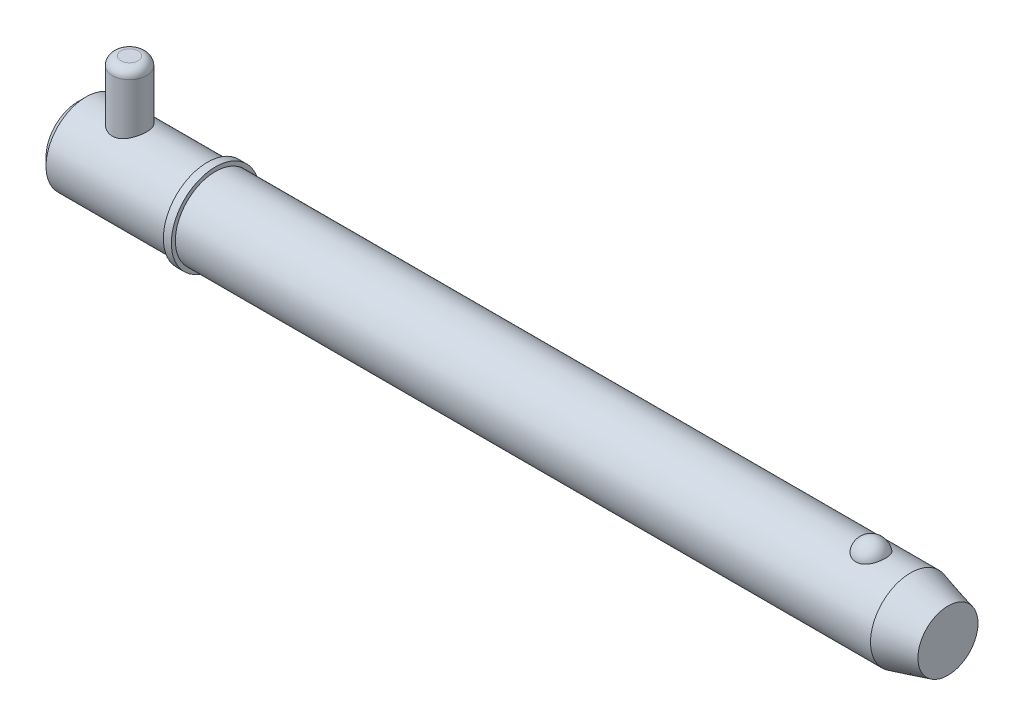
ISO-10303-21;
HEADER;
FILE_DESCRIPTION(('STEP AP214'),'2;1');
FILE_NAME('part.step','',(''),(''),'','','');
FILE_SCHEMA(('AUTOMOTIVE_DESIGN { 1 0 10303 214 1 1 1 1 }'));
ENDSEC;
DATA;
#1=APPLICATION_CONTEXT('core data for automotive mechanical design processes');
#2=APPLICATION_PROTOCOL_DEFINITION('international standard','automotive_design',2000,#1);
#3=PRODUCT_CONTEXT('',#1,'mechanical');
#4=PRODUCT('Part','Part','',(#3));
#5=PRODUCT_RELATED_PRODUCT_CATEGORY('part','',(#4));
#6=PRODUCT_DEFINITION_FORMATION('','',#4);
#7=PRODUCT_DEFINITION_CONTEXT('part definition',#1,'design');
#8=PRODUCT_DEFINITION('design','',#6,#7);
#9=PRODUCT_DEFINITION_SHAPE('','',#8);
#10=(LENGTH_UNIT() NAMED_UNIT(*) SI_UNIT(.MILLI.,.METRE.));
#11=(NAMED_UNIT(*) PLANE_ANGLE_UNIT() SI_UNIT($,.RADIAN.));
#12=(NAMED_UNIT(*) SI_UNIT($,.STERADIAN.) SOLID_ANGLE_UNIT());
#13=UNCERTAINTY_MEASURE_WITH_UNIT(LENGTH_MEASURE(1.E-05),#10,'distance_accuracy_value','');
#14=(GEOMETRIC_REPRESENTATION_CONTEXT(3) GLOBAL_UNCERTAINTY_ASSIGNED_CONTEXT((#13)) GLOBAL_UNIT_ASSIGNED_CONTEXT((#10,
#11,#12)) REPRESENTATION_CONTEXT('',''));
#15=CARTESIAN_POINT('',(0.,0.,0.));
#16=DIRECTION('',(0.,0.,1.));
#17=DIRECTION('',(1.,0.,0.));
#18=AXIS2_PLACEMENT_3D('',#15,#16,#17);
#19=CARTESIAN_POINT('',(14.28,26.985,0.));
#20=DIRECTION('',(0.,-1.,0.));
#21=DIRECTION('',(0.,0.,-1.));
#22=AXIS2_PLACEMENT_3D('',#19,#20,#21);
#23=CYLINDRICAL_SURFACE('',#22,4.76);
#24=CARTESIAN_POINT('',(14.28,-8.73500000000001,0.));
#25=DIRECTION('',(0.,1.,0.));
#26=DIRECTION('',(0.,0.,1.));
#27=AXIS2_PLACEMENT_3D('',#24,#25,#26);
#28=CIRCLE('',#27,4.76);
#29=CARTESIAN_POINT('',(14.28,-8.73500000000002,-4.76));
#30=VERTEX_POINT('',#29);
#31=EDGE_CURVE('P0_E25',#30,#30,#28,.T.);
#32=CARTESIAN_POINT('',(14.28,24.605,0.));
#33=DIRECTION('',(0.,1.,0.));
#34=DIRECTION('',(0.,0.,1.));
#35=AXIS2_PLACEMENT_3D('',#32,#33,#34);
#36=CIRCLE('',#35,4.76);
#37=CARTESIAN_POINT('',(14.28,24.605,-4.76));
#38=VERTEX_POINT('',#37);
#39=EDGE_CURVE('P0_E29',#38,#38,#36,.F.);
#40=CARTESIAN_POINT('',(14.28,-8.73500000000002,-4.76));
#41=CARTESIAN_POINT('',(14.28,-8.38770833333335,-4.76));
#42=CARTESIAN_POINT('',(14.28,-8.04041666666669,-4.76));
#43=CARTESIAN_POINT('',(14.28,-7.34583333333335,-4.76));
#44=CARTESIAN_POINT('',(14.28,-6.99854166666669,-4.76));
#45=CARTESIAN_POINT('',(14.28,-6.30395833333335,-4.76));
#46=CARTESIAN_POINT('',(14.28,-5.95666666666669,-4.76));
#47=CARTESIAN_POINT('',(14.28,-5.26208333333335,-4.76));
#48=CARTESIAN_POINT('',(14.28,-4.91479166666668,-4.76));
#49=CARTESIAN_POINT('',(14.28,-4.22020833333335,-4.76));
#50=CARTESIAN_POINT('',(14.28,-3.87291666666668,-4.76));
#51=CARTESIAN_POINT('',(14.28,-3.17833333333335,-4.76));
#52=CARTESIAN_POINT('',(14.28,-2.83104166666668,-4.76));
#53=CARTESIAN_POINT('',(14.28,-2.13645833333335,-4.76));
#54=CARTESIAN_POINT('',(14.28,-1.78916666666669,-4.76));
#55=CARTESIAN_POINT('',(14.28,-1.09458333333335,-4.76));
#56=CARTESIAN_POINT('',(14.28,-0.747291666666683,-4.76));
#57=CARTESIAN_POINT('',(14.28,-0.052708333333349,-4.76));
#58=CARTESIAN_POINT('',(14.28,0.294583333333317,-4.76));
#59=CARTESIAN_POINT('',(14.28,0.989166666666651,-4.76));
#60=CARTESIAN_POINT('',(14.28,1.33645833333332,-4.76));
#61=CARTESIAN_POINT('',(14.28,2.03104166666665,-4.76));
#62=CARTESIAN_POINT('',(14.28,2.37833333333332,-4.76));
#63=CARTESIAN_POINT('',(14.28,3.07291666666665,-4.76));
#64=CARTESIAN_POINT('',(14.28,3.42020833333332,-4.76));
#65=CARTESIAN_POINT('',(14.28,4.11479166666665,-4.76));
#66=CARTESIAN_POINT('',(14.28,4.46208333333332,-4.76));
#67=CARTESIAN_POINT('',(14.28,5.15666666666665,-4.76));
#68=CARTESIAN_POINT('',(14.28,5.50395833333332,-4.76));
#69=CARTESIAN_POINT('',(14.28,6.19854166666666,-4.76));
#70=CARTESIAN_POINT('',(14.28,6.54583333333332,-4.76));
#71=CARTESIAN_POINT('',(14.28,7.24041666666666,-4.76));
#72=CARTESIAN_POINT('',(14.28,7.58770833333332,-4.76));
#73=CARTESIAN_POINT('',(14.28,8.28229166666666,-4.76));
#74=CARTESIAN_POINT('',(14.28,8.62958333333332,-4.76));
#75=CARTESIAN_POINT('',(14.28,9.32416666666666,-4.76));
#76=CARTESIAN_POINT('',(14.28,9.67145833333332,-4.76));
#77=CARTESIAN_POINT('',(14.28,10.3660416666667,-4.76));
#78=CARTESIAN_POINT('',(14.28,10.7133333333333,-4.76));
#79=CARTESIAN_POINT('',(14.28,11.4079166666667,-4.76));
#80=CARTESIAN_POINT('',(14.28,11.7552083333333,-4.76));
#81=CARTESIAN_POINT('',(14.28,12.4497916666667,-4.76));
#82=CARTESIAN_POINT('',(14.28,12.7970833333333,-4.76));
#83=CARTESIAN_POINT('',(14.28,13.4916666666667,-4.76));
#84=CARTESIAN_POINT('',(14.28,13.8389583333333,-4.76));
#85=CARTESIAN_POINT('',(14.28,14.5335416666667,-4.76));
#86=CARTESIAN_POINT('',(14.28,14.8808333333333,-4.76));
#87=CARTESIAN_POINT('',(14.28,15.5754166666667,-4.76));
#88=CARTESIAN_POINT('',(14.28,15.9227083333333,-4.76));
#89=CARTESIAN_POINT('',(14.28,16.6172916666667,-4.76));
#90=CARTESIAN_POINT('',(14.28,16.9645833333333,-4.76));
#91=CARTESIAN_POINT('',(14.28,17.6591666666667,-4.76));
#92=CARTESIAN_POINT('',(14.28,18.0064583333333,-4.76));
#93=CARTESIAN_POINT('',(14.28,18.7010416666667,-4.76));
#94=CARTESIAN_POINT('',(14.28,19.0483333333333,-4.76));
#95=CARTESIAN_POINT('',(14.28,19.7429166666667,-4.76));
#96=CARTESIAN_POINT('',(14.28,20.0902083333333,-4.76));
#97=CARTESIAN_POINT('',(14.28,20.7847916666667,-4.76));
#98=CARTESIAN_POINT('',(14.28,21.1320833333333,-4.76));
#99=CARTESIAN_POINT('',(14.28,21.8266666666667,-4.76));
#100=CARTESIAN_POINT('',(14.28,22.1739583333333,-4.76));
#101=CARTESIAN_POINT('',(14.28,22.8685416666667,-4.76));
#102=CARTESIAN_POINT('',(14.28,23.2158333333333,-4.76));
#103=CARTESIAN_POINT('',(14.28,23.9104166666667,-4.76));
#104=CARTESIAN_POINT('',(14.28,24.2577083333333,-4.76));
#105=CARTESIAN_POINT('',(14.28,24.605,-4.76));
#106=B_SPLINE_CURVE_WITH_KNOTS('',3,(#40,#41,#42,#43,#44,#45,#46,#47,#48,#49,#50,#51,#52,#53,
#54,#55,#56,#57,#58,#59,#60,#61,#62,#63,#64,#65,#66,#67,#68,#69,#70,#71,#72,#73,#74,#75,#76,#77,
#78,#79,#80,#81,#82,#83,#84,#85,#86,#87,#88,#89,#90,#91,#92,#93,#94,#95,#96,#97,#98,#99,#100,
#101,#102,#103,#104,#105),.UNSPECIFIED.,.F.,.F.,(4,2,2,2,2,2,2,2,2,2,2,2,2,2,2,2,2,2,2,2,2,2,2,
2,2,2,2,2,2,2,2,2,4),(0.,1.041875,2.08375,3.125625,4.1675,5.209375,6.25125,7.293125,
8.33500000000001,9.376875,10.41875,11.460625,12.5025,13.544375,14.58625,15.628125,16.67,
17.711875,18.75375,19.795625,20.8375,21.879375,22.92125,23.963125,25.005,26.046875,27.08875,
28.130625,29.1725,30.214375,31.25625,32.298125,33.34),.UNSPECIFIED.);
#107=EDGE_CURVE('P0_BSEAM14',#30,#38,#106,.T.);
#108=ORIENTED_EDGE('',*,*,#31,.T.);
#109=ORIENTED_EDGE('',*,*,#39,.T.);
#110=ORIENTED_EDGE('',*,*,#107,.T.);
#111=ORIENTED_EDGE('',*,*,#107,.F.);
#112=EDGE_LOOP('',(#108,#110,#109,#111));
#113=FACE_BOUND('',#112,.T.);
#114=ADVANCED_FACE('P0_F14',(#113),#23,.T.);
#115=CARTESIAN_POINT('',(14.28,26.985,0.));
#116=DIRECTION('',(0.,1.,0.));
#117=DIRECTION('',(0.,0.,1.));
#118=AXIS2_PLACEMENT_3D('',#115,#116,#117);
#119=PLANE('',#118);
#120=CARTESIAN_POINT('',(14.28,26.985,0.));
#121=DIRECTION('',(0.,1.,0.));
#122=DIRECTION('',(0.,0.,1.));
#123=AXIS2_PLACEMENT_3D('',#120,#121,#122);
#124=CIRCLE('',#123,2.38);
#125=CARTESIAN_POINT('',(14.28,26.985,2.38));
#126=VERTEX_POINT('',#125);
#127=EDGE_CURVE('P0_E10',#126,#126,#124,.T.);
#128=ORIENTED_EDGE('',*,*,#127,.T.);
#129=EDGE_LOOP('',(#128));
#130=FACE_BOUND('',#129,.T.);
#131=ADVANCED_FACE('P0_F46',(#130),#119,.T.);
#132=CARTESIAN_POINT('',(14.28,-11.115,0.));
#133=DIRECTION('',(0.,1.,0.));
#134=DIRECTION('',(0.,0.,1.));
#135=AXIS2_PLACEMENT_3D('',#132,#133,#134);
#136=PLANE('',#135);
#137=CARTESIAN_POINT('',(14.28,-11.115,0.));
#138=DIRECTION('',(0.,1.,0.));
#139=DIRECTION('',(0.,0.,1.));
#140=AXIS2_PLACEMENT_3D('',#137,#138,#139);
#141=CIRCLE('',#140,2.38);
#142=CARTESIAN_POINT('',(14.28,-11.115,2.38));
#143=VERTEX_POINT('',#142);
#144=EDGE_CURVE('P0_E21',#143,#143,#141,.F.);
#145=ORIENTED_EDGE('',*,*,#144,.T.);
#146=EDGE_LOOP('',(#145));
#147=FACE_BOUND('',#146,.T.);
#148=ADVANCED_FACE('P0_F43',(#147),#136,.F.);
#149=CARTESIAN_POINT('',(14.28,-8.735,0.));
#150=DIRECTION('',(0.,1.,0.));
#151=DIRECTION('',(0.,0.,1.));
#152=AXIS2_PLACEMENT_3D('',#149,#150,#151);
#153=DEGENERATE_TOROIDAL_SURFACE('',#152,2.38,2.38,.T.);
#154=ORIENTED_EDGE('',*,*,#144,.F.);
#155=EDGE_LOOP('',(#154));
#156=FACE_BOUND('',#155,.T.);
#157=ORIENTED_EDGE('',*,*,#31,.F.);
#158=EDGE_LOOP('',(#157));
#159=FACE_BOUND('',#158,.T.);
#160=ADVANCED_FACE('P0_F38',(#156,#159),#153,.T.);
#161=CARTESIAN_POINT('',(14.28,24.605,0.));
#162=DIRECTION('',(0.,1.,0.));
#163=DIRECTION('',(0.,0.,1.));
#164=AXIS2_PLACEMENT_3D('',#161,#162,#163);
#165=DEGENERATE_TOROIDAL_SURFACE('',#164,2.38,2.38,.T.);
#166=ORIENTED_EDGE('',*,*,#39,.F.);
#167=EDGE_LOOP('',(#166));
#168=FACE_BOUND('',#167,.T.);
#169=ORIENTED_EDGE('',*,*,#127,.F.);
#170=EDGE_LOOP('',(#169));
#171=FACE_BOUND('',#170,.T.);
#172=ADVANCED_FACE('P0_F16',(#168,#171),#165,.T.);
#173=CLOSED_SHELL('',(#114,#131,#148,#160,#172));
#174=MANIFOLD_SOLID_BREP('P0_B1',#173);
#175=CARTESIAN_POINT('',(0.,0.,0.));
#176=DIRECTION('',(1.,0.,0.));
#177=DIRECTION('',(0.,0.,-1.));
#178=AXIS2_PLACEMENT_3D('',#175,#176,#177);
#179=CYLINDRICAL_SURFACE('',#178,11.115);
#180=CARTESIAN_POINT('',(230.929563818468,0.,0.));
#181=DIRECTION('',(1.,0.,0.));
#182=DIRECTION('',(0.,0.,-1.));
#183=AXIS2_PLACEMENT_3D('',#180,#181,#182);
#184=CIRCLE('',#183,11.115);
#185=CARTESIAN_POINT('',(230.929563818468,0.,-11.115));
#186=VERTEX_POINT('',#185);
#187=EDGE_CURVE('P1_E81',#186,#186,#184,.T.);
#188=ORIENTED_EDGE('',*,*,#187,.F.);
#189=EDGE_LOOP('',(#188));
#190=FACE_BOUND('',#189,.T.);
#191=CARTESIAN_POINT('',(38.1,0.,0.));
#192=DIRECTION('',(1.,0.,0.));
#193=DIRECTION('',(0.,0.,-1.));
#194=AXIS2_PLACEMENT_3D('',#191,#192,#193);
#195=CIRCLE('',#194,11.115);
#196=CARTESIAN_POINT('',(38.1,0.,-11.115));
#197=VERTEX_POINT('',#196);
#198=EDGE_CURVE('P1_E85',#197,#197,#195,.T.);
#199=ORIENTED_EDGE('',*,*,#198,.T.);
#200=EDGE_LOOP('',(#199));
#201=FACE_BOUND('',#200,.T.);
#202=CARTESIAN_POINT('',(219.931068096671,10.3028087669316,4.17077409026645));
#203=CARTESIAN_POINT('',(219.714775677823,10.3028003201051,4.17078240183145));
#204=CARTESIAN_POINT('',(219.498548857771,10.3098895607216,4.15340593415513));
#205=CARTESIAN_POINT('',(219.072540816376,10.3373834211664,4.08449540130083));
#206=CARTESIAN_POINT('',(218.862757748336,10.3577841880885,4.0329712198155));
#207=CARTESIAN_POINT('',(218.455782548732,10.4095237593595,3.89746513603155));
#208=CARTESIAN_POINT('',(218.258572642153,10.4408466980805,3.81353029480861));
#209=CARTESIAN_POINT('',(217.881338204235,10.5110236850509,3.61560339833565));
#210=CARTESIAN_POINT('',(217.701317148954,10.5498792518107,3.50160528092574));
#211=CARTESIAN_POINT('',(217.357684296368,10.6322884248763,3.24292464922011));
#212=CARTESIAN_POINT('',(217.194686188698,10.6759443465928,3.09746040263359));
#213=CARTESIAN_POINT('',(216.894591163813,10.7625291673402,2.7817192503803));
#214=CARTESIAN_POINT('',(216.757499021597,10.8054579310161,2.61143778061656));
#215=CARTESIAN_POINT('',(216.506408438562,10.8881935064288,2.24226695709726));
#216=CARTESIAN_POINT('',(216.393710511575,10.9277761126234,2.04244123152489));
#217=CARTESIAN_POINT('',(216.201777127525,10.997484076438,1.62578254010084));
#218=CARTESIAN_POINT('',(216.122544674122,11.0276085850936,1.40894804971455));
#219=CARTESIAN_POINT('',(215.998303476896,11.0756732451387,0.961250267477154));
#220=CARTESIAN_POINT('',(215.953760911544,11.0934470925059,0.730239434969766));
#221=CARTESIAN_POINT('',(215.901569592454,11.1143331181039,0.263439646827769));
#222=CARTESIAN_POINT('',(215.893920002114,11.1174456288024,0.0276507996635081));
#223=CARTESIAN_POINT('',(215.91561056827,11.1087161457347,-0.440729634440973));
#224=CARTESIAN_POINT('',(215.944762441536,11.0969502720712,-0.6733313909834));
#225=CARTESIAN_POINT('',(216.039143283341,11.0597872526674,-1.12996621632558));
#226=CARTESIAN_POINT('',(216.104372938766,11.0343898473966,-1.35399912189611));
#227=CARTESIAN_POINT('',(216.26969844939,10.972515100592,-1.78750286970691));
#228=CARTESIAN_POINT('',(216.36983863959,10.9360236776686,-1.99695478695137));
#229=CARTESIAN_POINT('',(216.602940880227,10.8557595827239,-2.39520667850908));
#230=CARTESIAN_POINT('',(216.735905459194,10.8119863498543,-2.58400506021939));
#231=CARTESIAN_POINT('',(217.032407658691,10.7216733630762,-2.93635726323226));
#232=CARTESIAN_POINT('',(217.196056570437,10.675123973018,-3.09981510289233));
#233=CARTESIAN_POINT('',(217.549860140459,10.5846571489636,-3.39592247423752));
#234=CARTESIAN_POINT('',(217.740012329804,10.5407394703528,-3.52857487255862));
#235=CARTESIAN_POINT('',(218.13750141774,10.4616690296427,-3.75646057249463));
#236=CARTESIAN_POINT('',(218.34436705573,10.4263443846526,-3.85245432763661));
#237=CARTESIAN_POINT('',(218.772954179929,10.3675574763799,-4.00798747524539));
#238=CARTESIAN_POINT('',(218.994670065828,10.344090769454,-4.0675405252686));
#239=CARTESIAN_POINT('',(219.434669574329,10.3128282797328,-4.14614314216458));
#240=CARTESIAN_POINT('',(219.652565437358,10.3043040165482,-4.1670783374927));
#241=CARTESIAN_POINT('',(220.08894951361,10.3016771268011,-4.17357158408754));
#242=CARTESIAN_POINT('',(220.307437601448,10.3075716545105,-4.15913661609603));
#243=CARTESIAN_POINT('',(220.731744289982,10.3326686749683,-4.09636961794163));
#244=CARTESIAN_POINT('',(220.937745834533,10.3514555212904,-4.0490957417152));
#245=CARTESIAN_POINT('',(221.338576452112,10.399818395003,-3.92320197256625));
#246=CARTESIAN_POINT('',(221.5334046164,10.4293952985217,-3.84457953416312));
#247=CARTESIAN_POINT('',(221.911191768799,10.4969600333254,-3.65612410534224));
#248=CARTESIAN_POINT('',(222.093797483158,10.5351178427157,-3.54564545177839));
#249=CARTESIAN_POINT('',(222.438204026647,10.6154999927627,-3.29718036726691));
#250=CARTESIAN_POINT('',(222.600000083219,10.657725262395,-3.15918764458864));
#251=CARTESIAN_POINT('',(222.906959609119,10.744212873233,-2.85163580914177));
#252=CARTESIAN_POINT('',(223.050891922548,10.7884718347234,-2.68084605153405));
#253=CARTESIAN_POINT('',(223.309237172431,10.872374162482,-2.31721864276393));
#254=CARTESIAN_POINT('',(223.423644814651,10.9120167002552,-2.12437704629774));
#255=CARTESIAN_POINT('',(223.623873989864,10.9838919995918,-1.71516999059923));
#256=CARTESIAN_POINT('',(223.70866178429,11.0158465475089,-1.49824866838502));
#257=CARTESIAN_POINT('',(223.84268382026,11.0673523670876,-1.05228572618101));
#258=CARTESIAN_POINT('',(223.891917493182,11.086903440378,-0.823243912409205));
#259=CARTESIAN_POINT('',(223.953891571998,11.1116323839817,-0.359087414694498));
#260=CARTESIAN_POINT('',(223.966566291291,11.1167843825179,-0.12396256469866));
#261=CARTESIAN_POINT('',(223.954973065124,11.1121144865,0.345220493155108));
#262=CARTESIAN_POINT('',(223.930705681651,11.1022928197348,0.579278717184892));
#263=CARTESIAN_POINT('',(223.845907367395,11.0687504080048,1.03866534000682));
#264=CARTESIAN_POINT('',(223.785529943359,11.0450885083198,1.26402641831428));
#265=CARTESIAN_POINT('',(223.629853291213,10.9863185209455,1.70076772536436));
#266=CARTESIAN_POINT('',(223.534551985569,10.9512097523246,1.91214712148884));
#267=CARTESIAN_POINT('',(223.310397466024,10.8729733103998,2.316083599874));
#268=CARTESIAN_POINT('',(223.181380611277,10.8298068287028,2.50854240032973));
#269=CARTESIAN_POINT('',(222.892732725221,10.7401896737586,2.86808766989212));
#270=CARTESIAN_POINT('',(222.733102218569,10.6937390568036,3.03517457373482));
#271=CARTESIAN_POINT('',(222.387534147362,10.6029321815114,3.33857581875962));
#272=CARTESIAN_POINT('',(222.201708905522,10.5585680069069,3.47501541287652));
#273=CARTESIAN_POINT('',(221.807875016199,10.4769321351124,3.71390897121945));
#274=CARTESIAN_POINT('',(221.599863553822,10.439661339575,3.81635861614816));
#275=CARTESIAN_POINT('',(221.154066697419,10.3749407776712,3.98910631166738));
#276=CARTESIAN_POINT('',(220.915234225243,10.3482457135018,4.05700929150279));
#277=CARTESIAN_POINT('',(220.427925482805,10.312188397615,4.14782844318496));
#278=CARTESIAN_POINT('',(220.179453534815,10.3028184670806,4.17076454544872));
#279=CARTESIAN_POINT('',(219.931068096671,10.3028087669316,4.17077409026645));
#280=B_SPLINE_CURVE_WITH_KNOTS('',3,(#202,#203,#204,#205,#206,#207,#208,#209,#210,#211,#212,
#213,#214,#215,#216,#217,#218,#219,#220,#221,#222,#223,#224,#225,#226,#227,#228,#229,#230,#231,
#232,#233,#234,#235,#236,#237,#238,#239,#240,#241,#242,#243,#244,#245,#246,#247,#248,#249,#250,
#251,#252,#253,#254,#255,#256,#257,#258,#259,#260,#261,#262,#263,#264,#265,#266,#267,#268,#269,
#270,#271,#272,#273,#274,#275,#276,#277,#278,#279),.UNSPECIFIED.,.T.,.F.,(4,2,2,2,2,2,2,2,2,2,2,
2,2,2,2,2,2,2,2,2,2,2,2,2,2,2,2,2,2,2,2,2,2,2,2,2,2,2,4),(0.,0.64796614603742,1.29574482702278,
1.94258643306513,2.58955857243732,3.25496465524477,3.92049326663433,4.61566368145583,
5.31089647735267,6.01531821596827,6.71972398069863,7.42054043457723,8.12137023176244,
8.82309331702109,9.52487047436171,10.2292439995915,10.9335519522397,11.6223330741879,
12.3108558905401,12.9647664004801,13.6185478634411,14.252184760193,14.8858731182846,
15.5334360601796,16.1811472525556,16.8611459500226,17.5412664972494,18.2431855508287,
18.9451158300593,19.6483065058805,20.3514864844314,21.0516982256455,21.7519516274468,
22.4556690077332,23.1593743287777,23.860149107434,24.5610129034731,25.3054529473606,
26.049562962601),.UNSPECIFIED.);
#281=CARTESIAN_POINT('',(219.931068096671,10.3028087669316,4.17077409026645));
#282=VERTEX_POINT('',#281);
#283=EDGE_CURVE('P1_E35',#282,#282,#280,.T.);
#284=ORIENTED_EDGE('',*,*,#283,.T.);
#285=EDGE_LOOP('',(#284));
#286=FACE_BOUND('',#285,.T.);
#287=ADVANCED_FACE('P1_F13',(#190,#201,#286),#179,.T.);
#288=CARTESIAN_POINT('',(0.,0.,0.));
#289=DIRECTION('',(-1.,0.,0.));
#290=DIRECTION('',(0.,0.,1.));
#291=AXIS2_PLACEMENT_3D('',#288,#289,#290);
#292=PLANE('',#291);
#293=CARTESIAN_POINT('',(0.,0.,0.));
#294=DIRECTION('',(1.,0.,0.));
#295=DIRECTION('',(0.,0.,-1.));
#296=AXIS2_PLACEMENT_3D('',#293,#294,#295);
#297=CIRCLE('',#296,8.892);
#298=CARTESIAN_POINT('',(0.,0.,-8.892));
#299=VERTEX_POINT('',#298);
#300=EDGE_CURVE('P1_E9',#299,#299,#297,.T.);
#301=ORIENTED_EDGE('',*,*,#300,.F.);
#302=EDGE_LOOP('',(#301));
#303=FACE_BOUND('',#302,.T.);
#304=ADVANCED_FACE('P1_F15',(#303),#292,.T.);
#305=CARTESIAN_POINT('',(2.22299999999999,0.,0.));
#306=DIRECTION('',(1.,0.,0.));
#307=DIRECTION('',(0.,0.,-1.));
#308=AXIS2_PLACEMENT_3D('',#305,#306,#307);
#309=CONICAL_SURFACE('',#308,11.115,0.78539816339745);
#310=ORIENTED_EDGE('',*,*,#300,.T.);
#311=EDGE_LOOP('',(#310));
#312=FACE_BOUND('',#311,.T.);
#313=CARTESIAN_POINT('',(2.22299999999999,0.,0.));
#314=DIRECTION('',(1.,0.,0.));
#315=DIRECTION('',(0.,0.,-1.));
#316=AXIS2_PLACEMENT_3D('',#313,#314,#315);
#317=CIRCLE('',#316,11.115);
#318=CARTESIAN_POINT('',(2.22299999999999,0.,-11.115));
#319=VERTEX_POINT('',#318);
#320=EDGE_CURVE('P1_E26',#319,#319,#317,.T.);
#321=ORIENTED_EDGE('',*,*,#320,.F.);
#322=EDGE_LOOP('',(#321));
#323=FACE_BOUND('',#322,.T.);
#324=ADVANCED_FACE('P1_F77',(#312,#323),#309,.T.);
#325=CARTESIAN_POINT('',(0.,0.,0.));
#326=DIRECTION('',(1.,0.,0.));
#327=DIRECTION('',(0.,0.,-1.));
#328=AXIS2_PLACEMENT_3D('',#325,#326,#327);
#329=CYLINDRICAL_SURFACE('',#328,11.115);
#330=CARTESIAN_POINT('',(14.28,-10.0441836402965,4.76));
#331=CARTESIAN_POINT('',(14.1533731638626,-10.0441846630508,4.75999904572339));
#332=CARTESIAN_POINT('',(14.0267055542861,-10.0465865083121,4.75493985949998));
#333=CARTESIAN_POINT('',(13.774298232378,-10.0561141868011,4.73475585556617));
#334=CARTESIAN_POINT('',(13.6485591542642,-10.0632429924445,4.71962470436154));
#335=CARTESIAN_POINT('',(13.3987500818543,-10.0819979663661,4.67942666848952));
#336=CARTESIAN_POINT('',(13.2746840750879,-10.0936334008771,4.65433930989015));
#337=CARTESIAN_POINT('',(13.0293244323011,-10.1210146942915,4.59449317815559));
#338=CARTESIAN_POINT('',(12.9080319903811,-10.1367622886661,4.55973032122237));
#339=CARTESIAN_POINT('',(12.669614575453,-10.1717810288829,4.48106435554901));
#340=CARTESIAN_POINT('',(12.5524727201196,-10.1910352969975,4.4372048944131));
#341=CARTESIAN_POINT('',(12.3224300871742,-10.2325403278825,4.34063417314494));
#342=CARTESIAN_POINT('',(12.2095309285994,-10.2547922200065,4.28791957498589));
#343=CARTESIAN_POINT('',(11.8782785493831,-10.3250879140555,4.11715127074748));
#344=CARTESIAN_POINT('',(11.6670799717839,-10.3767168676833,3.98637638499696));
#345=CARTESIAN_POINT('',(11.2564039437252,-10.4874309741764,3.68567149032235));
#346=CARTESIAN_POINT('',(11.0583793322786,-10.5467772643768,3.51386978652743));
#347=CARTESIAN_POINT('',(10.6927724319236,-10.6641377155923,3.13969960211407));
#348=CARTESIAN_POINT('',(10.5252022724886,-10.7221513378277,2.93731900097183));
#349=CARTESIAN_POINT('',(10.2965609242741,-10.8050020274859,2.60935726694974));
#350=CARTESIAN_POINT('',(10.2227768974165,-10.8324811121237,2.49310321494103));
#351=CARTESIAN_POINT('',(10.0853380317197,-10.884703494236,2.25418999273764));
#352=CARTESIAN_POINT('',(10.0216789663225,-10.9094479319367,2.13153352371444));
#353=CARTESIAN_POINT('',(9.90506238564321,-10.9554932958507,1.88060370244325));
#354=CARTESIAN_POINT('',(9.85210574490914,-10.9767939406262,1.7523298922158));
#355=CARTESIAN_POINT('',(9.75746464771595,-11.0153112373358,1.49115740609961));
#356=CARTESIAN_POINT('',(9.71577447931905,-11.0325299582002,1.35826111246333));
#357=CARTESIAN_POINT('',(9.64605475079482,-11.0615607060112,1.09614539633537));
#358=CARTESIAN_POINT('',(9.61740732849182,-11.0736151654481,0.96711700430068));
#359=CARTESIAN_POINT('',(9.57092026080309,-11.0932687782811,0.706847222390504));
#360=CARTESIAN_POINT('',(9.55307574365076,-11.1008699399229,0.575606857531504));
#361=CARTESIAN_POINT('',(9.52838640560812,-11.1114054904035,0.31192917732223));
#362=CARTESIAN_POINT('',(9.52153986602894,-11.114340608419,0.179492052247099));
#363=CARTESIAN_POINT('',(9.51892405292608,-11.1154607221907,-0.0855090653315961));
#364=CARTESIAN_POINT('',(9.52315432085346,-11.1136459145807,-0.218073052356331));
#365=CARTESIAN_POINT('',(9.542009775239,-11.1055891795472,-0.473709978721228));
#366=CARTESIAN_POINT('',(9.55594693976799,-11.099640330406,-0.596843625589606));
#367=CARTESIAN_POINT('',(9.59332832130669,-11.0837823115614,-0.841440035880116));
#368=CARTESIAN_POINT('',(9.61677567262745,-11.0738718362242,-0.962902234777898));
#369=CARTESIAN_POINT('',(9.67294089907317,-11.0503378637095,-1.20325684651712));
#370=CARTESIAN_POINT('',(9.70565569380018,-11.0367156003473,-1.32215009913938));
#371=CARTESIAN_POINT('',(9.78005008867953,-11.0060908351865,-1.55666640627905));
#372=CARTESIAN_POINT('',(9.82173311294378,-10.9890870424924,-1.67228819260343));
#373=CARTESIAN_POINT('',(9.96110379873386,-10.9330280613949,-2.01656166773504));
#374=CARTESIAN_POINT('',(10.0722987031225,-10.8892801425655,-2.23915547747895));
#375=CARTESIAN_POINT('',(10.3268588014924,-10.7934745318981,-2.66299199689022));
#376=CARTESIAN_POINT('',(10.4702355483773,-10.7414138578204,-2.86422700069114));
#377=CARTESIAN_POINT('',(10.7973904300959,-10.6296201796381,-3.25557775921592));
#378=CARTESIAN_POINT('',(10.9833705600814,-10.569604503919,-3.443774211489));
#379=CARTESIAN_POINT('',(11.3844486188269,-10.4514707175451,-3.78722133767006));
#380=CARTESIAN_POINT('',(11.5995590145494,-10.3933534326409,-3.94245783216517));
#381=CARTESIAN_POINT('',(11.9444340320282,-10.311516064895,-4.14990014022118));
#382=CARTESIAN_POINT('',(12.0654579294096,-10.2847012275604,-4.21573894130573));
#383=CARTESIAN_POINT('',(12.3132718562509,-10.2342051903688,-4.33688518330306));
#384=CARTESIAN_POINT('',(12.4400593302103,-10.2105226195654,-4.39219723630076));
#385=CARTESIAN_POINT('',(12.6985418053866,-10.1671237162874,-4.49174500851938));
#386=CARTESIAN_POINT('',(12.8302359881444,-10.1474067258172,-4.53598256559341));
#387=CARTESIAN_POINT('',(13.0975061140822,-10.1126841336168,-4.61287629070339));
#388=CARTESIAN_POINT('',(13.233079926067,-10.0976759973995,-4.64553869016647));
#389=CARTESIAN_POINT('',(13.4978553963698,-10.0737863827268,-4.6971059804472));
#390=CARTESIAN_POINT('',(13.6268754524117,-10.0645618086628,-4.716785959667));
#391=CARTESIAN_POINT('',(13.8862990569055,-10.051062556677,-4.74548419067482));
#392=CARTESIAN_POINT('',(14.0167019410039,-10.0467856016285,-4.75450734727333));
#393=CARTESIAN_POINT('',(14.277859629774,-10.0433352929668,-4.76179143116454));
#394=CARTESIAN_POINT('',(14.4086143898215,-10.0441613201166,-4.76005366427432));
#395=CARTESIAN_POINT('',(14.6694025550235,-10.0508838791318,-4.74584231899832));
#396=CARTESIAN_POINT('',(14.7994359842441,-10.0567802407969,-4.73336910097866));
#397=CARTESIAN_POINT('',(15.0487369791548,-10.0728449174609,-4.69907984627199));
#398=CARTESIAN_POINT('',(15.1681238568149,-10.0826872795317,-4.67797462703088));
#399=CARTESIAN_POINT('',(15.4045894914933,-10.1062580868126,-4.62682977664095));
#400=CARTESIAN_POINT('',(15.5216674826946,-10.1199877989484,-4.59678723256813));
#401=CARTESIAN_POINT('',(15.868278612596,-10.1664161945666,-4.49365911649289));
#402=CARTESIAN_POINT('',(16.0933756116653,-10.2043671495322,-4.40754694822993));
#403=CARTESIAN_POINT('',(16.5357981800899,-10.2919879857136,-4.19898201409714));
#404=CARTESIAN_POINT('',(16.7523611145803,-10.3420954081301,-4.07511281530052));
#405=CARTESIAN_POINT('',(17.1627188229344,-10.4477911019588,-3.7959429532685));
#406=CARTESIAN_POINT('',(17.3565033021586,-10.5033818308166,-3.64062816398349));
#407=CARTESIAN_POINT('',(17.7334034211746,-10.6196376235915,-3.28693729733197));
#408=CARTESIAN_POINT('',(17.9141276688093,-10.6803237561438,-3.08599175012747));
#409=CARTESIAN_POINT('',(18.1582189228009,-10.7666348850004,-2.76320365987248));
#410=CARTESIAN_POINT('',(18.2351223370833,-10.7946346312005,-2.65197124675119));
#411=CARTESIAN_POINT('',(18.3793967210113,-10.8483267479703,-2.42297927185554));
#412=CARTESIAN_POINT('',(18.4467718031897,-10.87402011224,-2.30522255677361));
#413=CARTESIAN_POINT('',(18.5717669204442,-10.9225249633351,-2.06324665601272));
#414=CARTESIAN_POINT('',(18.6293326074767,-10.9453202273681,-1.93899615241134));
#415=CARTESIAN_POINT('',(18.73370006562,-10.9872100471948,-1.6855059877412));
#416=CARTESIAN_POINT('',(18.7805065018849,-11.0063062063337,-1.55626851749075));
#417=CARTESIAN_POINT('',(18.8628731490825,-11.0402419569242,-1.29375150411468));
#418=CARTESIAN_POINT('',(18.8984366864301,-11.0550828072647,-1.16047316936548));
#419=CARTESIAN_POINT('',(18.9579183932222,-11.0800638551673,-0.890912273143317));
#420=CARTESIAN_POINT('',(18.9818374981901,-11.0902044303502,-0.75462995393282));
#421=CARTESIAN_POINT('',(19.0164177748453,-11.104911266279,-0.490295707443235));
#422=CARTESIAN_POINT('',(19.027922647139,-11.1098318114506,-0.362373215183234));
#423=CARTESIAN_POINT('',(19.040554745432,-11.1152360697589,-0.105876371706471));
#424=CARTESIAN_POINT('',(19.0416784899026,-11.1157182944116,0.0226981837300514));
#425=CARTESIAN_POINT('',(19.0335275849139,-11.1122291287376,0.27938352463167));
#426=CARTESIAN_POINT('',(19.0242587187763,-11.1082602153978,0.407494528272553));
#427=CARTESIAN_POINT('',(18.9954320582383,-11.0959792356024,0.662388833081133));
#428=CARTESIAN_POINT('',(18.9758704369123,-11.0876655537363,0.789171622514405));
#429=CARTESIAN_POINT('',(18.9276379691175,-11.0673259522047,1.03545890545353));
#430=CARTESIAN_POINT('',(18.8993573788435,-11.0554596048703,1.15505309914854));
#431=CARTESIAN_POINT('',(18.8337694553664,-11.0282166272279,1.39134516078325));
#432=CARTESIAN_POINT('',(18.7964589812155,-11.0128387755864,1.5080420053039));
#433=CARTESIAN_POINT('',(18.671464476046,-10.9619666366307,1.85262797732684));
#434=CARTESIAN_POINT('',(18.5706772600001,-10.9217161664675,2.07521484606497));
#435=CARTESIAN_POINT('',(18.33202463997,-10.8301378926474,2.51061719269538));
#436=CARTESIAN_POINT('',(18.1926775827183,-10.7783885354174,2.72252375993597));
#437=CARTESIAN_POINT('',(17.8829747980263,-10.669863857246,3.12088015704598));
#438=CARTESIAN_POINT('',(17.7126068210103,-10.6130865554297,3.30731987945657));
#439=CARTESIAN_POINT('',(17.3310036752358,-10.495668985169,3.66358491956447));
#440=CARTESIAN_POINT('',(17.1177010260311,-10.4350471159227,3.83122543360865));
#441=CARTESIAN_POINT('',(16.7778915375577,-10.3495418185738,4.05420569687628));
#442=CARTESIAN_POINT('',(16.6612023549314,-10.3219229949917,4.12383380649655));
#443=CARTESIAN_POINT('',(16.4218466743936,-10.2693487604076,4.25306463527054));
#444=CARTESIAN_POINT('',(16.2991829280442,-10.2443921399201,4.31267191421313));
#445=CARTESIAN_POINT('',(16.0488008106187,-10.1979981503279,4.42126071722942));
#446=CARTESIAN_POINT('',(15.9210894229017,-10.1765561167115,4.47025635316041));
#447=CARTESIAN_POINT('',(15.6613937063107,-10.1379191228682,4.55720152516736));
#448=CARTESIAN_POINT('',(15.5294115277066,-10.1207220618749,4.59515652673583));
#449=CARTESIAN_POINT('',(15.2624981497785,-10.091252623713,4.65951684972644));
#450=CARTESIAN_POINT('',(15.1275757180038,-10.0789672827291,4.68595259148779));
#451=CARTESIAN_POINT('',(14.8556442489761,-10.0597530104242,4.72706206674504));
#452=CARTESIAN_POINT('',(14.7186368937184,-10.0528199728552,4.74174481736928));
#453=CARTESIAN_POINT('',(14.5310955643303,-10.047196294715,4.75363843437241));
#454=CARTESIAN_POINT('',(14.48091543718,-10.0460674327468,4.75602323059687));
#455=CARTESIAN_POINT('',(14.3804923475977,-10.044560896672,4.7592042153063));
#456=CARTESIAN_POINT('',(14.3302493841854,-10.0441832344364,4.76000037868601));
#457=CARTESIAN_POINT('',(14.28,-10.0441836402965,4.76));
#458=B_SPLINE_CURVE_WITH_KNOTS('',3,(#330,#331,#332,#333,#334,#335,#336,#337,#338,#339,#340,
#341,#342,#343,#344,#345,#346,#347,#348,#349,#350,#351,#352,#353,#354,#355,#356,#357,#358,#359,
#360,#361,#362,#363,#364,#365,#366,#367,#368,#369,#370,#371,#372,#373,#374,#375,#376,#377,#378,
#379,#380,#381,#382,#383,#384,#385,#386,#387,#388,#389,#390,#391,#392,#393,#394,#395,#396,#397,
#398,#399,#400,#401,#402,#403,#404,#405,#406,#407,#408,#409,#410,#411,#412,#413,#414,#415,#416,
#417,#418,#419,#420,#421,#422,#423,#424,#425,#426,#427,#428,#429,#430,#431,#432,#433,#434,#435,
#436,#437,#438,#439,#440,#441,#442,#443,#444,#445,#446,#447,#448,#449,#450,#451,#452,#453,#454,
#455,#456,#457),.UNSPECIFIED.,.T.,.F.,(4,2,2,2,2,2,2,2,2,2,2,2,2,2,2,2,2,2,2,2,2,2,2,2,2,2,2,2,
2,2,2,2,2,2,2,2,2,2,2,2,2,2,2,2,2,2,2,2,2,2,2,2,2,2,2,2,2,2,2,2,2,2,2,4),(0.,0.379828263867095,
0.759895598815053,1.14074858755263,1.52176256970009,1.90098898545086,2.28035867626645,
3.03818035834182,3.84125131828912,4.6446414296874,5.06541657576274,5.48601561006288,
5.90664899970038,6.3270687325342,6.72470503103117,7.12216187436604,7.51955659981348,
7.91693487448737,8.28868404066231,8.66055582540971,9.03230414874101,9.40419465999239,
10.1585834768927,10.9132435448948,11.7236471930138,12.5343987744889,12.9550196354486,
13.3754557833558,13.7958221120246,14.2159617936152,14.6079540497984,14.9997658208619,
15.3915300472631,15.7832811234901,16.1477615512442,16.512360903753,17.240999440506,
18.0012974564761,18.761937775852,19.5886929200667,20.0025782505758,20.4162843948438,
20.832212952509,21.2479608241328,21.6635855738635,22.0791769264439,22.4642880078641,
22.8495282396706,23.2345541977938,23.6197234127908,23.9896813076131,24.3597680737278,
25.099327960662,25.8726239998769,26.6462260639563,27.4759193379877,27.8914891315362,
28.3068693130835,28.7216936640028,29.1363123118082,29.5498292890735,29.9630287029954,
30.113753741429,30.2644811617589),.UNSPECIFIED.);
#459=CARTESIAN_POINT('',(14.28,-10.0441836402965,4.76));
#460=VERTEX_POINT('',#459);
#461=EDGE_CURVE('P1_E17',#460,#460,#458,.T.);
#462=ORIENTED_EDGE('',*,*,#461,.F.);
#463=EDGE_LOOP('',(#462));
#464=FACE_BOUND('',#463,.T.);
#465=CARTESIAN_POINT('',(14.28,10.0441836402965,4.76));
#466=CARTESIAN_POINT('',(14.4066268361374,10.0441846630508,4.75999904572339));
#467=CARTESIAN_POINT('',(14.5332944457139,10.0465865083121,4.75493985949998));
#468=CARTESIAN_POINT('',(14.785701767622,10.0561141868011,4.73475585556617));
#469=CARTESIAN_POINT('',(14.9114408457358,10.0632429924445,4.71962470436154));
#470=CARTESIAN_POINT('',(15.1612499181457,10.0819979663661,4.67942666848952));
#471=CARTESIAN_POINT('',(15.2853159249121,10.0936334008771,4.65433930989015));
#472=CARTESIAN_POINT('',(15.5306755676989,10.1210146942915,4.59449317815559));
#473=CARTESIAN_POINT('',(15.6519680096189,10.1367622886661,4.55973032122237));
#474=CARTESIAN_POINT('',(15.890385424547,10.1717810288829,4.48106435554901));
#475=CARTESIAN_POINT('',(16.0075272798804,10.1910352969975,4.4372048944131));
#476=CARTESIAN_POINT('',(16.2375699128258,10.2325403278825,4.34063417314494));
#477=CARTESIAN_POINT('',(16.3504690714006,10.2547922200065,4.28791957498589));
#478=CARTESIAN_POINT('',(16.6817214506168,10.3250879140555,4.11715127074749));
#479=CARTESIAN_POINT('',(16.8929200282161,10.3767168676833,3.98637638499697));
#480=CARTESIAN_POINT('',(17.3035960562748,10.4874309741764,3.68567149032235));
#481=CARTESIAN_POINT('',(17.5016206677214,10.5467772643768,3.51386978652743));
#482=CARTESIAN_POINT('',(17.8672275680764,10.6641377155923,3.13969960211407));
#483=CARTESIAN_POINT('',(18.0347977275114,10.7221513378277,2.93731900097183));
#484=CARTESIAN_POINT('',(18.2634390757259,10.8050020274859,2.60935726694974));
#485=CARTESIAN_POINT('',(18.3372231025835,10.8324811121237,2.49310321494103));
#486=CARTESIAN_POINT('',(18.4746619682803,10.884703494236,2.25418999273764));
#487=CARTESIAN_POINT('',(18.5383210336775,10.9094479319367,2.13153352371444));
#488=CARTESIAN_POINT('',(18.6549376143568,10.9554932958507,1.88060370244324));
#489=CARTESIAN_POINT('',(18.7078942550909,10.9767939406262,1.75232989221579));
#490=CARTESIAN_POINT('',(18.8025353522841,11.0153112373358,1.4911574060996));
#491=CARTESIAN_POINT('',(18.844225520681,11.0325299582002,1.35826111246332));
#492=CARTESIAN_POINT('',(18.9139452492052,11.0615607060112,1.09614539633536));
#493=CARTESIAN_POINT('',(18.9425926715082,11.0736151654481,0.967117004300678));
#494=CARTESIAN_POINT('',(18.9890797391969,11.0932687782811,0.706847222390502));
#495=CARTESIAN_POINT('',(19.0069242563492,11.1008699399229,0.575606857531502));
#496=CARTESIAN_POINT('',(19.0316135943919,11.1114054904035,0.311929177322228));
#497=CARTESIAN_POINT('',(19.0384601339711,11.114340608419,0.179492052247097));
#498=CARTESIAN_POINT('',(19.0410759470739,11.1154607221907,-0.0855090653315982));
#499=CARTESIAN_POINT('',(19.0368456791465,11.1136459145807,-0.218073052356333));
#500=CARTESIAN_POINT('',(19.017990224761,11.1055891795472,-0.47370997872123));
#501=CARTESIAN_POINT('',(19.004053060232,11.099640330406,-0.596843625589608));
#502=CARTESIAN_POINT('',(18.9666716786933,11.0837823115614,-0.841440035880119));
#503=CARTESIAN_POINT('',(18.9432243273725,11.0738718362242,-0.9629022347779));
#504=CARTESIAN_POINT('',(18.8870591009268,11.0503378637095,-1.20325684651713));
#505=CARTESIAN_POINT('',(18.8543443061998,11.0367156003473,-1.32215009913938));
#506=CARTESIAN_POINT('',(18.7799499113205,11.0060908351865,-1.55666640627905));
#507=CARTESIAN_POINT('',(18.7382668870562,10.9890870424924,-1.67228819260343));
#508=CARTESIAN_POINT('',(18.5988962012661,10.9330280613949,-2.01656166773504));
#509=CARTESIAN_POINT('',(18.4877012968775,10.8892801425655,-2.23915547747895));
#510=CARTESIAN_POINT('',(18.2331411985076,10.7934745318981,-2.66299199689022));
#511=CARTESIAN_POINT('',(18.0897644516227,10.7414138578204,-2.86422700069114));
#512=CARTESIAN_POINT('',(17.7626095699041,10.6296201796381,-3.25557775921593));
#513=CARTESIAN_POINT('',(17.5766294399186,10.569604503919,-3.443774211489));
#514=CARTESIAN_POINT('',(17.1755513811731,10.4514707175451,-3.78722133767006));
#515=CARTESIAN_POINT('',(16.9604409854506,10.3933534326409,-3.94245783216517));
#516=CARTESIAN_POINT('',(16.6155659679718,10.311516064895,-4.14990014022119));
#517=CARTESIAN_POINT('',(16.4945420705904,10.2847012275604,-4.21573894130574));
#518=CARTESIAN_POINT('',(16.2467281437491,10.2342051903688,-4.33688518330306));
#519=CARTESIAN_POINT('',(16.1199406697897,10.2105226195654,-4.39219723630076));
#520=CARTESIAN_POINT('',(15.8614581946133,10.1671237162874,-4.49174500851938));
#521=CARTESIAN_POINT('',(15.7297640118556,10.1474067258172,-4.53598256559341));
#522=CARTESIAN_POINT('',(15.4624938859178,10.1126841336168,-4.61287629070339));
#523=CARTESIAN_POINT('',(15.326920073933,10.0976759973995,-4.64553869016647));
#524=CARTESIAN_POINT('',(15.0621446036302,10.0737863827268,-4.6971059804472));
#525=CARTESIAN_POINT('',(14.9331245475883,10.0645618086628,-4.716785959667));
#526=CARTESIAN_POINT('',(14.6737009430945,10.051062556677,-4.74548419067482));
#527=CARTESIAN_POINT('',(14.543298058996,10.0467856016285,-4.75450734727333));
#528=CARTESIAN_POINT('',(14.2821403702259,10.0433352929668,-4.76179143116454));
#529=CARTESIAN_POINT('',(14.1513856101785,10.0441613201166,-4.76005366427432));
#530=CARTESIAN_POINT('',(13.8905974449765,10.0508838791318,-4.74584231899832));
#531=CARTESIAN_POINT('',(13.7605640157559,10.0567802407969,-4.73336910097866));
#532=CARTESIAN_POINT('',(13.5112630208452,10.0728449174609,-4.69907984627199));
#533=CARTESIAN_POINT('',(13.3918761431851,10.0826872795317,-4.67797462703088));
#534=CARTESIAN_POINT('',(13.1554105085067,10.1062580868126,-4.62682977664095));
#535=CARTESIAN_POINT('',(13.0383325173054,10.1199877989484,-4.59678723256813));
#536=CARTESIAN_POINT('',(12.691721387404,10.1664161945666,-4.49365911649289));
#537=CARTESIAN_POINT('',(12.4666243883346,10.2043671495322,-4.40754694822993));
#538=CARTESIAN_POINT('',(12.0242018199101,10.2919879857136,-4.19898201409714));
#539=CARTESIAN_POINT('',(11.8076388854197,10.3420954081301,-4.07511281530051));
#540=CARTESIAN_POINT('',(11.3972811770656,10.4477911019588,-3.7959429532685));
#541=CARTESIAN_POINT('',(11.2034966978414,10.5033818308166,-3.64062816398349));
#542=CARTESIAN_POINT('',(10.8265965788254,10.6196376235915,-3.28693729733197));
#543=CARTESIAN_POINT('',(10.6458723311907,10.6803237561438,-3.08599175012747));
#544=CARTESIAN_POINT('',(10.4017810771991,10.7666348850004,-2.76320365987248));
#545=CARTESIAN_POINT('',(10.3248776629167,10.7946346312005,-2.65197124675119));
#546=CARTESIAN_POINT('',(10.1806032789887,10.8483267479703,-2.42297927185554));
#547=CARTESIAN_POINT('',(10.1132281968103,10.87402011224,-2.30522255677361));
#548=CARTESIAN_POINT('',(9.98823307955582,10.9225249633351,-2.06324665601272));
#549=CARTESIAN_POINT('',(9.93066739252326,10.9453202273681,-1.93899615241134));
#550=CARTESIAN_POINT('',(9.82629993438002,10.9872100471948,-1.6855059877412));
#551=CARTESIAN_POINT('',(9.77949349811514,11.0063062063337,-1.55626851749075));
#552=CARTESIAN_POINT('',(9.69712685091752,11.0402419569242,-1.29375150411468));
#553=CARTESIAN_POINT('',(9.66156331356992,11.0550828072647,-1.16047316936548));
#554=CARTESIAN_POINT('',(9.60208160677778,11.0800638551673,-0.890912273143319));
#555=CARTESIAN_POINT('',(9.57816250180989,11.0902044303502,-0.754629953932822));
#556=CARTESIAN_POINT('',(9.54358222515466,11.104911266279,-0.490295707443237));
#557=CARTESIAN_POINT('',(9.53207735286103,11.1098318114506,-0.362373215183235));
#558=CARTESIAN_POINT('',(9.51944525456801,11.1152360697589,-0.105876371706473));
#559=CARTESIAN_POINT('',(9.51832151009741,11.1157182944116,0.0226981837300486));
#560=CARTESIAN_POINT('',(9.52647241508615,11.1122291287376,0.279383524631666));
#561=CARTESIAN_POINT('',(9.53574128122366,11.1082602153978,0.407494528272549));
#562=CARTESIAN_POINT('',(9.5645679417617,11.0959792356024,0.662388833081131));
#563=CARTESIAN_POINT('',(9.58412956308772,11.0876655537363,0.789171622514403));
#564=CARTESIAN_POINT('',(9.63236203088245,11.0673259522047,1.03545890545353));
#565=CARTESIAN_POINT('',(9.66064262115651,11.0554596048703,1.15505309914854));
#566=CARTESIAN_POINT('',(9.72623054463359,11.0282166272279,1.39134516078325));
#567=CARTESIAN_POINT('',(9.76354101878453,11.0128387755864,1.5080420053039));
#568=CARTESIAN_POINT('',(9.88853552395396,10.9619666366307,1.85262797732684));
#569=CARTESIAN_POINT('',(9.98932273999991,10.9217161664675,2.07521484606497));
#570=CARTESIAN_POINT('',(10.22797536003,10.8301378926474,2.51061719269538));
#571=CARTESIAN_POINT('',(10.3673224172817,10.7783885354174,2.72252375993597));
#572=CARTESIAN_POINT('',(10.6770252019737,10.669863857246,3.12088015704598));
#573=CARTESIAN_POINT('',(10.8473931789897,10.6130865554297,3.30731987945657));
#574=CARTESIAN_POINT('',(11.2289963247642,10.495668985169,3.66358491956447));
#575=CARTESIAN_POINT('',(11.4422989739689,10.4350471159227,3.83122543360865));
#576=CARTESIAN_POINT('',(11.7821084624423,10.3495418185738,4.05420569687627));
#577=CARTESIAN_POINT('',(11.8987976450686,10.3219229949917,4.12383380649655));
#578=CARTESIAN_POINT('',(12.1381533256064,10.2693487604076,4.25306463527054));
#579=CARTESIAN_POINT('',(12.2608170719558,10.2443921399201,4.31267191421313));
#580=CARTESIAN_POINT('',(12.5111991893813,10.1979981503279,4.42126071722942));
#581=CARTESIAN_POINT('',(12.6389105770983,10.1765561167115,4.47025635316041));
#582=CARTESIAN_POINT('',(12.8986062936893,10.1379191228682,4.55720152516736));
#583=CARTESIAN_POINT('',(13.0305884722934,10.1207220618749,4.59515652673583));
#584=CARTESIAN_POINT('',(13.2975018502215,10.091252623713,4.65951684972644));
#585=CARTESIAN_POINT('',(13.4324242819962,10.0789672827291,4.68595259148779));
#586=CARTESIAN_POINT('',(13.7043557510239,10.0597530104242,4.72706206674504));
#587=CARTESIAN_POINT('',(13.8413631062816,10.0528199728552,4.74174481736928));
#588=CARTESIAN_POINT('',(14.0289044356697,10.047196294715,4.75363843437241));
#589=CARTESIAN_POINT('',(14.07908456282,10.0460674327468,4.75602323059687));
#590=CARTESIAN_POINT('',(14.1795076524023,10.044560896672,4.7592042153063));
#591=CARTESIAN_POINT('',(14.2297506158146,10.0441832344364,4.76000037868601));
#592=CARTESIAN_POINT('',(14.28,10.0441836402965,4.76));
#593=B_SPLINE_CURVE_WITH_KNOTS('',3,(#465,#466,#467,#468,#469,#470,#471,#472,#473,#474,#475,
#476,#477,#478,#479,#480,#481,#482,#483,#484,#485,#486,#487,#488,#489,#490,#491,#492,#493,#494,
#495,#496,#497,#498,#499,#500,#501,#502,#503,#504,#505,#506,#507,#508,#509,#510,#511,#512,#513,
#514,#515,#516,#517,#518,#519,#520,#521,#522,#523,#524,#525,#526,#527,#528,#529,#530,#531,#532,
#533,#534,#535,#536,#537,#538,#539,#540,#541,#542,#543,#544,#545,#546,#547,#548,#549,#550,#551,
#552,#553,#554,#555,#556,#557,#558,#559,#560,#561,#562,#563,#564,#565,#566,#567,#568,#569,#570,
#571,#572,#573,#574,#575,#576,#577,#578,#579,#580,#581,#582,#583,#584,#585,#586,#587,#588,#589,
#590,#591,#592),.UNSPECIFIED.,.T.,.F.,(4,2,2,2,2,2,2,2,2,2,2,2,2,2,2,2,2,2,2,2,2,2,2,2,2,2,2,2,
2,2,2,2,2,2,2,2,2,2,2,2,2,2,2,2,2,2,2,2,2,2,2,2,2,2,2,2,2,2,2,2,2,2,2,4),(0.,0.379828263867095,
0.759895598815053,1.14074858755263,1.52176256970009,1.90098898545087,2.28035867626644,
3.03818035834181,3.84125131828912,4.6446414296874,5.06541657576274,5.48601561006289,
5.90664899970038,6.3270687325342,6.72470503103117,7.12216187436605,7.51955659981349,
7.91693487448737,8.28868404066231,8.66055582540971,9.03230414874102,9.4041946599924,
10.1585834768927,10.9132435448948,11.7236471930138,12.5343987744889,12.9550196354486,
13.3754557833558,13.7958221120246,14.2159617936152,14.6079540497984,14.9997658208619,
15.3915300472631,15.7832811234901,16.1477615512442,16.512360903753,17.240999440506,
18.0012974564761,18.761937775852,19.5886929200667,20.0025782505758,20.4162843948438,
20.832212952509,21.2479608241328,21.6635855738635,22.0791769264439,22.4642880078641,
22.8495282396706,23.2345541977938,23.6197234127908,23.9896813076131,24.3597680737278,
25.099327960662,25.8726239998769,26.6462260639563,27.4759193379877,27.8914891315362,
28.3068693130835,28.7216936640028,29.1363123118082,29.5498292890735,29.9630287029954,
30.113753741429,30.2644811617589),.UNSPECIFIED.);
#594=CARTESIAN_POINT('',(14.28,10.0441836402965,4.76));
#595=VERTEX_POINT('',#594);
#596=EDGE_CURVE('P1_E43',#595,#595,#593,.T.);
#597=ORIENTED_EDGE('',*,*,#596,.F.);
#598=EDGE_LOOP('',(#597));
#599=FACE_BOUND('',#598,.T.);
#600=ORIENTED_EDGE('',*,*,#320,.T.);
#601=EDGE_LOOP('',(#600));
#602=FACE_BOUND('',#601,.T.);
#603=CARTESIAN_POINT('',(35.877,0.,0.));
#604=DIRECTION('',(1.,0.,0.));
#605=DIRECTION('',(0.,0.,-1.));
#606=AXIS2_PLACEMENT_3D('',#603,#604,#605);
#607=CIRCLE('',#606,11.115);
#608=CARTESIAN_POINT('',(35.877,0.,-11.115));
#609=VERTEX_POINT('',#608);
#610=EDGE_CURVE('P1_E31',#609,#609,#607,.T.);
#611=ORIENTED_EDGE('',*,*,#610,.F.);
#612=EDGE_LOOP('',(#611));
#613=FACE_BOUND('',#612,.T.);
#614=ADVANCED_FACE('P1_F103',(#464,#599,#602,#613),#329,.T.);
#615=CARTESIAN_POINT('',(35.877,11.115,0.));
#616=DIRECTION('',(-1.,0.,0.));
#617=DIRECTION('',(0.,0.,1.));
#618=AXIS2_PLACEMENT_3D('',#615,#616,#617);
#619=PLANE('',#618);
#620=ORIENTED_EDGE('',*,*,#610,.T.);
#621=EDGE_LOOP('',(#620));
#622=FACE_BOUND('',#621,.T.);
#623=CARTESIAN_POINT('',(35.877,0.,0.));
#624=DIRECTION('',(1.,0.,0.));
#625=DIRECTION('',(0.,0.,-1.));
#626=AXIS2_PLACEMENT_3D('',#623,#624,#625);
#627=CIRCLE('',#626,12.2265);
#628=CARTESIAN_POINT('',(35.877,0.,-12.2265));
#629=VERTEX_POINT('',#628);
#630=EDGE_CURVE('P1_E91',#629,#629,#627,.T.);
#631=ORIENTED_EDGE('',*,*,#630,.F.);
#632=EDGE_LOOP('',(#631));
#633=FACE_BOUND('',#632,.T.);
#634=ADVANCED_FACE('P1_F100',(#622,#633),#619,.T.);
#635=CARTESIAN_POINT('',(0.,0.,0.));
#636=DIRECTION('',(1.,0.,0.));
#637=DIRECTION('',(0.,0.,-1.));
#638=AXIS2_PLACEMENT_3D('',#635,#636,#637);
#639=CYLINDRICAL_SURFACE('',#638,12.2265);
#640=ORIENTED_EDGE('',*,*,#630,.T.);
#641=EDGE_LOOP('',(#640));
#642=FACE_BOUND('',#641,.T.);
#643=CARTESIAN_POINT('',(38.1,0.,0.));
#644=DIRECTION('',(1.,0.,0.));
#645=DIRECTION('',(0.,0.,-1.));
#646=AXIS2_PLACEMENT_3D('',#643,#644,#645);
#647=CIRCLE('',#646,12.2265);
#648=CARTESIAN_POINT('',(38.1,0.,-12.2265));
#649=VERTEX_POINT('',#648);
#650=EDGE_CURVE('P1_E88',#649,#649,#647,.T.);
#651=ORIENTED_EDGE('',*,*,#650,.F.);
#652=EDGE_LOOP('',(#651));
#653=FACE_BOUND('',#652,.T.);
#654=ADVANCED_FACE('P1_F68',(#642,#653),#639,.T.);
#655=CARTESIAN_POINT('',(38.1,12.2265,0.));
#656=DIRECTION('',(1.,0.,0.));
#657=DIRECTION('',(0.,0.,-1.));
#658=AXIS2_PLACEMENT_3D('',#655,#656,#657);
#659=PLANE('',#658);
#660=ORIENTED_EDGE('',*,*,#650,.T.);
#661=EDGE_LOOP('',(#660));
#662=FACE_BOUND('',#661,.T.);
#663=ORIENTED_EDGE('',*,*,#198,.F.);
#664=EDGE_LOOP('',(#663));
#665=FACE_BOUND('',#664,.T.);
#666=ADVANCED_FACE('P1_F62',(#662,#665),#659,.T.);
#667=CARTESIAN_POINT('',(241.3,0.,0.));
#668=DIRECTION('',(-1.,0.,0.));
#669=DIRECTION('',(0.,0.,1.));
#670=AXIS2_PLACEMENT_3D('',#667,#668,#669);
#671=CONICAL_SURFACE('',#670,8.33625000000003,0.26179938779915);
#672=ORIENTED_EDGE('',*,*,#187,.T.);
#673=EDGE_LOOP('',(#672));
#674=FACE_BOUND('',#673,.T.);
#675=CARTESIAN_POINT('',(241.3,0.,0.));
#676=DIRECTION('',(1.,0.,0.));
#677=DIRECTION('',(0.,0.,-1.));
#678=AXIS2_PLACEMENT_3D('',#675,#676,#677);
#679=CIRCLE('',#678,8.33625000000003);
#680=CARTESIAN_POINT('',(241.3,0.,-8.33625000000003));
#681=VERTEX_POINT('',#680);
#682=EDGE_CURVE('P1_E42',#681,#681,#679,.T.);
#683=ORIENTED_EDGE('',*,*,#682,.F.);
#684=EDGE_LOOP('',(#683));
#685=FACE_BOUND('',#684,.T.);
#686=ADVANCED_FACE('P1_F59',(#674,#685),#671,.T.);
#687=CARTESIAN_POINT('',(241.3,8.33625000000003,0.));
#688=DIRECTION('',(1.,0.,0.));
#689=DIRECTION('',(0.,0.,-1.));
#690=AXIS2_PLACEMENT_3D('',#687,#688,#689);
#691=PLANE('',#690);
#692=ORIENTED_EDGE('',*,*,#682,.T.);
#693=EDGE_LOOP('',(#692));
#694=FACE_BOUND('',#693,.T.);
#695=ADVANCED_FACE('P1_F55',(#694),#691,.T.);
#696=CARTESIAN_POINT('',(219.931068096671,10.0035,0.));
#697=DIRECTION('',(-1.,0.,0.));
#698=DIRECTION('',(0.,1.,0.));
#699=AXIS2_PLACEMENT_3D('',#696,#697,#698);
#700=SPHERICAL_SURFACE('',#699,4.18150000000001);
#701=ORIENTED_EDGE('',*,*,#283,.F.);
#702=EDGE_LOOP('',(#701));
#703=FACE_BOUND('',#702,.T.);
#704=ADVANCED_FACE('P1_F50',(#703),#700,.T.);
#705=CARTESIAN_POINT('',(14.28,-12.2265,0.));
#706=DIRECTION('',(0.,1.,0.));
#707=DIRECTION('',(0.,0.,1.));
#708=AXIS2_PLACEMENT_3D('',#705,#706,#707);
#709=CYLINDRICAL_SURFACE('',#708,4.76);
#710=ORIENTED_EDGE('',*,*,#461,.T.);
#711=EDGE_LOOP('',(#710));
#712=FACE_BOUND('',#711,.T.);
#713=ORIENTED_EDGE('',*,*,#596,.T.);
#714=EDGE_LOOP('',(#713));
#715=FACE_BOUND('',#714,.T.);
#716=ADVANCED_FACE('P1_F54',(#712,#715),#709,.F.);
#717=CLOSED_SHELL('',(#287,#304,#324,#614,#634,#654,#666,#686,#695,#704,#716));
#718=MANIFOLD_SOLID_BREP('P1_B1',#717);
#719=ADVANCED_BREP_SHAPE_REPRESENTATION('',(#18,#174,#718),#14);
#720=SHAPE_DEFINITION_REPRESENTATION(#9,#719);
ENDSEC;
END-ISO-10303-21;
